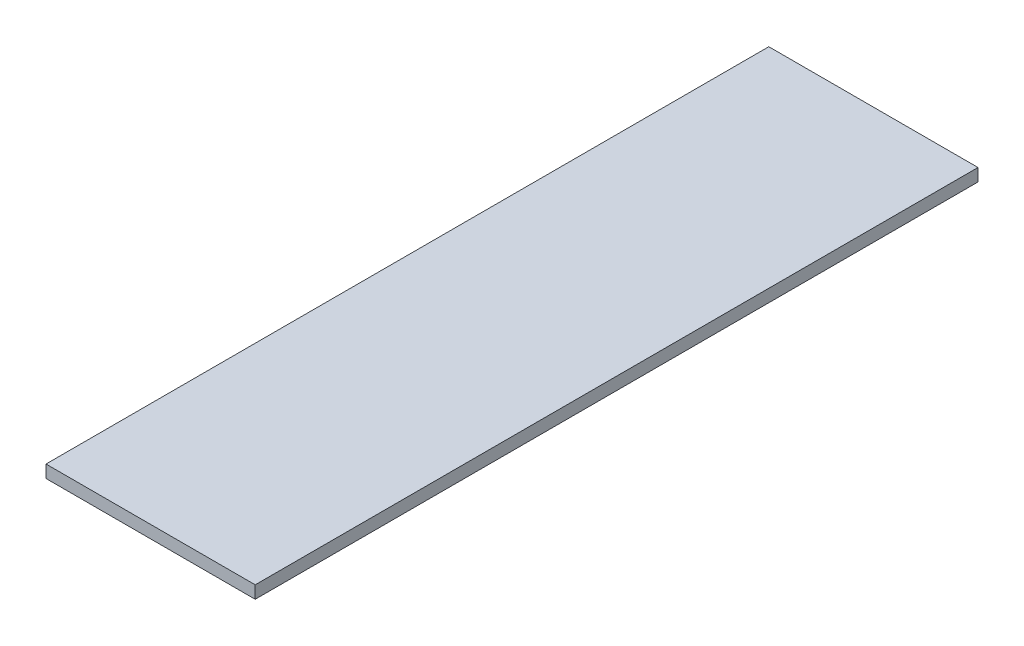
ISO-10303-21;
HEADER;
FILE_DESCRIPTION(('STEP AP214'),'2;1');
FILE_NAME('part.step','',(''),(''),'','','');
FILE_SCHEMA(('AUTOMOTIVE_DESIGN { 1 0 10303 214 1 1 1 1 }'));
ENDSEC;
DATA;
#1=APPLICATION_CONTEXT('core data for automotive mechanical design processes');
#2=APPLICATION_PROTOCOL_DEFINITION('international standard','automotive_design',2000,#1);
#3=PRODUCT_CONTEXT('',#1,'mechanical');
#4=PRODUCT('Part','Part','',(#3));
#5=PRODUCT_RELATED_PRODUCT_CATEGORY('part','',(#4));
#6=PRODUCT_DEFINITION_FORMATION('','',#4);
#7=PRODUCT_DEFINITION_CONTEXT('part definition',#1,'design');
#8=PRODUCT_DEFINITION('design','',#6,#7);
#9=PRODUCT_DEFINITION_SHAPE('','',#8);
#10=(LENGTH_UNIT() NAMED_UNIT(*) SI_UNIT(.MILLI.,.METRE.));
#11=(NAMED_UNIT(*) PLANE_ANGLE_UNIT() SI_UNIT($,.RADIAN.));
#12=(NAMED_UNIT(*) SI_UNIT($,.STERADIAN.) SOLID_ANGLE_UNIT());
#13=UNCERTAINTY_MEASURE_WITH_UNIT(LENGTH_MEASURE(1.E-05),#10,'distance_accuracy_value','');
#14=(GEOMETRIC_REPRESENTATION_CONTEXT(3) GLOBAL_UNCERTAINTY_ASSIGNED_CONTEXT((#13)) GLOBAL_UNIT_ASSIGNED_CONTEXT((#10,
#11,#12)) REPRESENTATION_CONTEXT('',''));
#15=CARTESIAN_POINT('',(0.,0.,0.));
#16=DIRECTION('',(0.,0.,1.));
#17=DIRECTION('',(1.,0.,0.));
#18=AXIS2_PLACEMENT_3D('',#15,#16,#17);
#19=CARTESIAN_POINT('',(100.,12.,345.5));
#20=DIRECTION('',(-1.,0.,0.));
#21=DIRECTION('',(0.,0.,1.));
#22=AXIS2_PLACEMENT_3D('',#19,#20,#21);
#23=PLANE('',#22);
#24=DIRECTION('',(0.,0.,-1.));
#25=VECTOR('',#24,1.);
#26=CARTESIAN_POINT('',(100.,0.,345.5));
#27=LINE('',#26,#25);
#28=CARTESIAN_POINT('',(100.,0.,345.5));
#29=VERTEX_POINT('',#28);
#30=CARTESIAN_POINT('',(100.,0.,-345.5));
#31=VERTEX_POINT('',#30);
#32=EDGE_CURVE('E96',#29,#31,#27,.T.);
#33=ORIENTED_EDGE('',*,*,#32,.T.);
#34=DIRECTION('',(0.,-1.,0.));
#35=VECTOR('',#34,1.);
#36=CARTESIAN_POINT('',(100.,12.,-345.5));
#37=LINE('',#36,#35);
#38=CARTESIAN_POINT('',(100.,12.,-345.5));
#39=VERTEX_POINT('',#38);
#40=EDGE_CURVE('E11',#39,#31,#37,.T.);
#41=ORIENTED_EDGE('',*,*,#40,.F.);
#42=DIRECTION('',(0.,0.,-1.));
#43=VECTOR('',#42,1.);
#44=CARTESIAN_POINT('',(100.,12.,345.5));
#45=LINE('',#44,#43);
#46=CARTESIAN_POINT('',(100.,12.,345.5));
#47=VERTEX_POINT('',#46);
#48=EDGE_CURVE('E84',#47,#39,#45,.T.);
#49=ORIENTED_EDGE('',*,*,#48,.F.);
#50=DIRECTION('',(0.,-1.,0.));
#51=VECTOR('',#50,1.);
#52=CARTESIAN_POINT('',(100.,12.,345.5));
#53=LINE('',#52,#51);
#54=EDGE_CURVE('E92',#47,#29,#53,.T.);
#55=ORIENTED_EDGE('',*,*,#54,.T.);
#56=EDGE_LOOP('',(#33,#41,#49,#55));
#57=FACE_BOUND('',#56,.T.);
#58=ADVANCED_FACE('F33',(#57),#23,.F.);
#59=CARTESIAN_POINT('',(-100.,12.,-345.5));
#60=DIRECTION('',(0.,0.,1.));
#61=DIRECTION('',(1.,0.,0.));
#62=AXIS2_PLACEMENT_3D('',#59,#60,#61);
#63=PLANE('',#62);
#64=DIRECTION('',(-1.,0.,0.));
#65=VECTOR('',#64,1.);
#66=CARTESIAN_POINT('',(-100.,0.,-345.5));
#67=LINE('',#66,#65);
#68=CARTESIAN_POINT('',(-100.,0.,-345.5));
#69=VERTEX_POINT('',#68);
#70=EDGE_CURVE('E88',#31,#69,#67,.T.);
#71=ORIENTED_EDGE('',*,*,#70,.T.);
#72=DIRECTION('',(0.,-1.,0.));
#73=VECTOR('',#72,1.);
#74=CARTESIAN_POINT('',(-100.,12.,-345.5));
#75=LINE('',#74,#73);
#76=CARTESIAN_POINT('',(-100.,12.,-345.5));
#77=VERTEX_POINT('',#76);
#78=EDGE_CURVE('E41',#77,#69,#75,.T.);
#79=ORIENTED_EDGE('',*,*,#78,.F.);
#80=DIRECTION('',(-1.,0.,0.));
#81=VECTOR('',#80,1.);
#82=CARTESIAN_POINT('',(-100.,12.,-345.5));
#83=LINE('',#82,#81);
#84=EDGE_CURVE('E79',#39,#77,#83,.T.);
#85=ORIENTED_EDGE('',*,*,#84,.F.);
#86=ORIENTED_EDGE('',*,*,#40,.T.);
#87=EDGE_LOOP('',(#71,#79,#85,#86));
#88=FACE_BOUND('',#87,.T.);
#89=ADVANCED_FACE('F87',(#88),#63,.F.);
#90=CARTESIAN_POINT('',(-100.,12.,345.5));
#91=DIRECTION('',(1.,0.,0.));
#92=DIRECTION('',(0.,0.,-1.));
#93=AXIS2_PLACEMENT_3D('',#90,#91,#92);
#94=PLANE('',#93);
#95=DIRECTION('',(0.,0.,1.));
#96=VECTOR('',#95,1.);
#97=CARTESIAN_POINT('',(-100.,0.,345.5));
#98=LINE('',#97,#96);
#99=CARTESIAN_POINT('',(-100.,0.,345.5));
#100=VERTEX_POINT('',#99);
#101=EDGE_CURVE('E66',#69,#100,#98,.T.);
#102=ORIENTED_EDGE('',*,*,#101,.T.);
#103=DIRECTION('',(0.,-1.,0.));
#104=VECTOR('',#103,1.);
#105=CARTESIAN_POINT('',(-100.,12.,345.5));
#106=LINE('',#105,#104);
#107=CARTESIAN_POINT('',(-100.,12.,345.5));
#108=VERTEX_POINT('',#107);
#109=EDGE_CURVE('E89',#108,#100,#106,.T.);
#110=ORIENTED_EDGE('',*,*,#109,.F.);
#111=DIRECTION('',(0.,0.,1.));
#112=VECTOR('',#111,1.);
#113=CARTESIAN_POINT('',(-100.,12.,345.5));
#114=LINE('',#113,#112);
#115=EDGE_CURVE('E82',#77,#108,#114,.T.);
#116=ORIENTED_EDGE('',*,*,#115,.F.);
#117=ORIENTED_EDGE('',*,*,#78,.T.);
#118=EDGE_LOOP('',(#102,#110,#116,#117));
#119=FACE_BOUND('',#118,.T.);
#120=ADVANCED_FACE('F90',(#119),#94,.F.);
#121=CARTESIAN_POINT('',(-100.,12.,345.5));
#122=DIRECTION('',(0.,0.,-1.));
#123=DIRECTION('',(-1.,0.,0.));
#124=AXIS2_PLACEMENT_3D('',#121,#122,#123);
#125=PLANE('',#124);
#126=DIRECTION('',(1.,0.,0.));
#127=VECTOR('',#126,1.);
#128=CARTESIAN_POINT('',(-100.,0.,345.5));
#129=LINE('',#128,#127);
#130=EDGE_CURVE('E72',#100,#29,#129,.T.);
#131=ORIENTED_EDGE('',*,*,#130,.T.);
#132=ORIENTED_EDGE('',*,*,#54,.F.);
#133=DIRECTION('',(1.,0.,0.));
#134=VECTOR('',#133,1.);
#135=CARTESIAN_POINT('',(-100.,12.,345.5));
#136=LINE('',#135,#134);
#137=EDGE_CURVE('E49',#108,#47,#136,.T.);
#138=ORIENTED_EDGE('',*,*,#137,.F.);
#139=ORIENTED_EDGE('',*,*,#109,.T.);
#140=EDGE_LOOP('',(#131,#132,#138,#139));
#141=FACE_BOUND('',#140,.T.);
#142=ADVANCED_FACE('F103',(#141),#125,.F.);
#143=CARTESIAN_POINT('',(0.,12.,0.));
#144=DIRECTION('',(0.,-1.,0.));
#145=DIRECTION('',(0.,0.,-1.));
#146=AXIS2_PLACEMENT_3D('',#143,#144,#145);
#147=PLANE('',#146);
#148=ORIENTED_EDGE('',*,*,#48,.T.);
#149=ORIENTED_EDGE('',*,*,#84,.T.);
#150=ORIENTED_EDGE('',*,*,#115,.T.);
#151=ORIENTED_EDGE('',*,*,#137,.T.);
#152=EDGE_LOOP('',(#148,#149,#150,#151));
#153=FACE_BOUND('',#152,.T.);
#154=ADVANCED_FACE('F80',(#153),#147,.F.);
#155=CARTESIAN_POINT('',(0.,0.,0.));
#156=DIRECTION('',(0.,-1.,0.));
#157=DIRECTION('',(0.,0.,-1.));
#158=AXIS2_PLACEMENT_3D('',#155,#156,#157);
#159=PLANE('',#158);
#160=ORIENTED_EDGE('',*,*,#32,.F.);
#161=ORIENTED_EDGE('',*,*,#130,.F.);
#162=ORIENTED_EDGE('',*,*,#101,.F.);
#163=ORIENTED_EDGE('',*,*,#70,.F.);
#164=EDGE_LOOP('',(#160,#161,#162,#163));
#165=FACE_BOUND('',#164,.T.);
#166=ADVANCED_FACE('F106',(#165),#159,.T.);
#167=CLOSED_SHELL('',(#58,#89,#120,#142,#154,#166));
#168=MANIFOLD_SOLID_BREP('B2',#167);
#169=ADVANCED_BREP_SHAPE_REPRESENTATION('',(#18,#168),#14);
#170=SHAPE_DEFINITION_REPRESENTATION(#9,#169);
ENDSEC;
END-ISO-10303-21;
